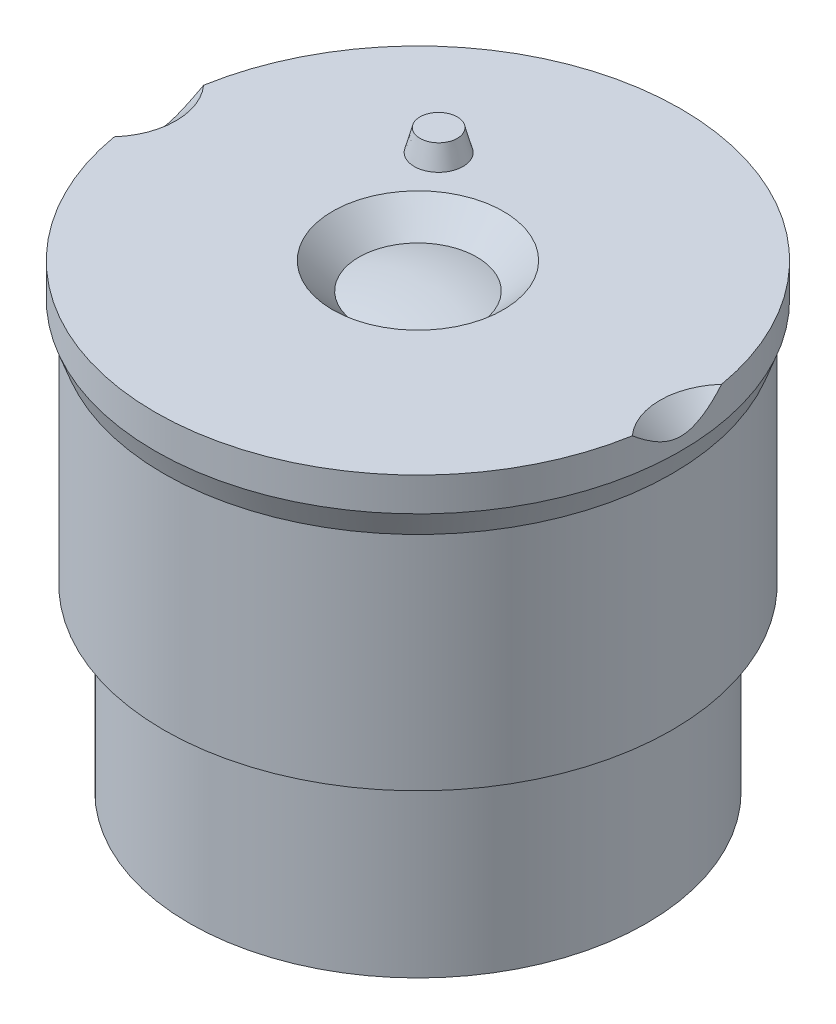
from build123d import *

# Parameters (mm, degrees)
SKETCH3_R           = 1.814550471
BOSS_EXTRUDE1_DEPTH = 1.6
BOSS_EXTRUDE1_TAPER = 15


with BuildPart() as part:
    # Sketch1 → Revolve1 (revolve)
    with BuildSketch(Plane.XY, mode=Mode.PRIVATE) as revolve1_sk:
        with BuildLine():
            Line((0, 0), (-17, 0))
            Line((-17, 0), (-17, 13.4))
            Line((-17, 13.4), (-18.9, 13.4))
            Line((-18.9, 13.4), (-18.9, 29.914139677))
            Line((-18.9, 29.914139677), (-19.55, 31.7))
            Line((-19.55, 31.7), (-19.55, 34.2))
            Line((-19.55, 34.2), (-6.35, 34.2))
            Line((-6.35, 34.2), (-4.383100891, 32.233100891))
            ThreePointArc((-4.383100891, 32.233100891), (-2.211719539, 32.679433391), (0, 32.82912091))
            Line((0, 32.82912091), (0, 0))
        make_face()
    revolve(revolve1_sk.sketch.rotate(Axis((0, 0, 0), (0, -1, 0)), 270), axis=Axis((0, 0, 0), (0, -1, 0)))

    # Sketch2 → Cut-Revolve1 (revolve, cut)
    with BuildSketch(Plane.XY):
        Polygon((-23, 34.2), (-23, 29.2), (-18, 34.2), align=None)
    cut_revolve1 = revolve(axis=Axis((-23, 35.919902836, 0), (0, -1, 0)), mode=Mode.SUBTRACT)

    # Mirror1: Cut-Revolve1 across plane
    add(cut_revolve1.mirror(Plane(origin=(0, 0, 0), x_dir=(0, 0, 1), z_dir=(1, 0, 0))), mode=Mode.SUBTRACT)

    # Sketch3 → Boss-Extrude1 (add)
    with BuildSketch(Plane(origin=(0, 34.2, 0), x_dir=(1, 0, 0), z_dir=(0, 1, 0))):
        with Locations((-6.192502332, 7.731881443)):
            Circle(SKETCH3_R)
    extrude(amount=BOSS_EXTRUDE1_DEPTH, taper=BOSS_EXTRUDE1_TAPER)


solid = part.part
